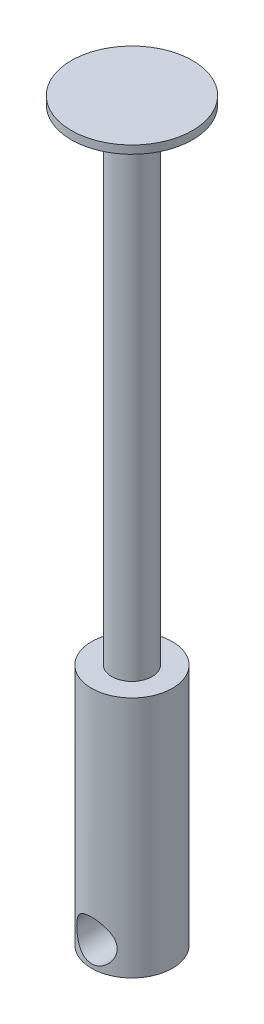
from build123d import *

# Parameters (mm, degrees)
SKETCH1_R               = 5
BOSS_EXTRUDE1_DEPTH     = 30
SKETCH2_R               = 2.5
BOSS_EXTRUDE2_DEPTH     = 60
SKETCH3_R               = 7.5
BOSS_EXTRUDE3_DEPTH     = 1
CUT_EXTRUDE1_DEPTH      = 92.616046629
CUT_EXTRUDE1_DEPTH_BACK = 92.616046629
SKETCH4_R               = 2.5


with BuildPart() as part:
    # Sketch1 → Boss-Extrude1 (new body)
    with BuildSketch(Plane(origin=(0, 0, 0), x_dir=(1, 0, 0), z_dir=(0, 1, 0))):
        with Locations(Location((0, 0, 0), (0, 0, 270))):
            Circle(SKETCH1_R)
    extrude(amount=BOSS_EXTRUDE1_DEPTH)

    # Sketch2 → Boss-Extrude2 (add)
    with BuildSketch(Plane(origin=(0, 30, 0), x_dir=(1, 0, 0), z_dir=(0, 1, 0))):
        with Locations(Location((0, 0, 0), (0, 0, 90))):
            Circle(SKETCH2_R)
    extrude(amount=BOSS_EXTRUDE2_DEPTH)

    # Sketch3 → Boss-Extrude3 (add)
    with BuildSketch(Plane(origin=(0, 90, 0), x_dir=(1, 0, 0), z_dir=(0, 1, 0))):
        with Locations(Location((0, 0, 0), (0, 0, 270))):
            Circle(SKETCH3_R)
    extrude(amount=BOSS_EXTRUDE3_DEPTH)

    # Sketch4 → Cut-Extrude1 (cut, two sides: drawn at the far end of the back side and taken through both)
    with BuildSketch(Plane.XY.offset(-CUT_EXTRUDE1_DEPTH_BACK)):
        with Locations(Location((0, 3, 0), (0, 0, 90.000000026))):
            Circle(SKETCH4_R)
    extrude(amount=CUT_EXTRUDE1_DEPTH + CUT_EXTRUDE1_DEPTH_BACK, mode=Mode.SUBTRACT)


solid = part.part
